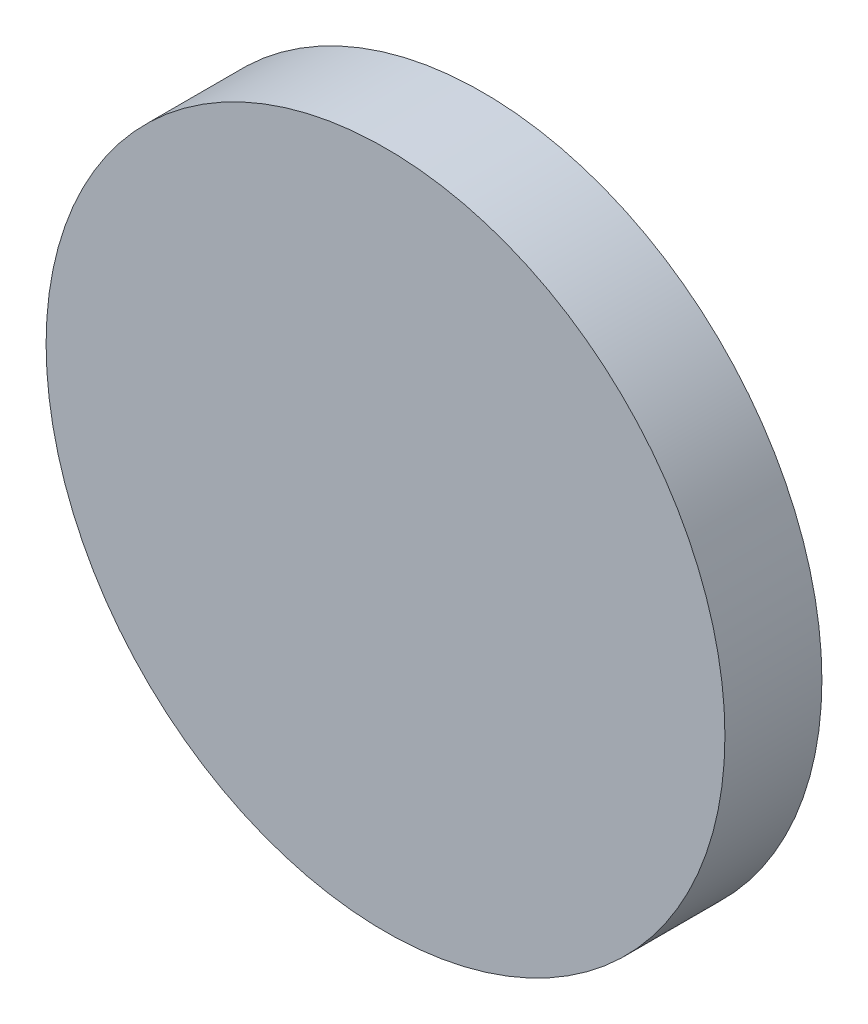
from build123d import *

# Parameters (mm, degrees)
CROQUIS1_R              = 3.5
SALIENTE_EXTRUIR1_DEPTH = 1


with BuildPart() as part:
    # Croquis1 → Saliente-Extruir1 (new body)
    with BuildSketch(Plane.XY):
        Circle(CROQUIS1_R)
    extrude(amount=SALIENTE_EXTRUIR1_DEPTH)


solid = part.part
